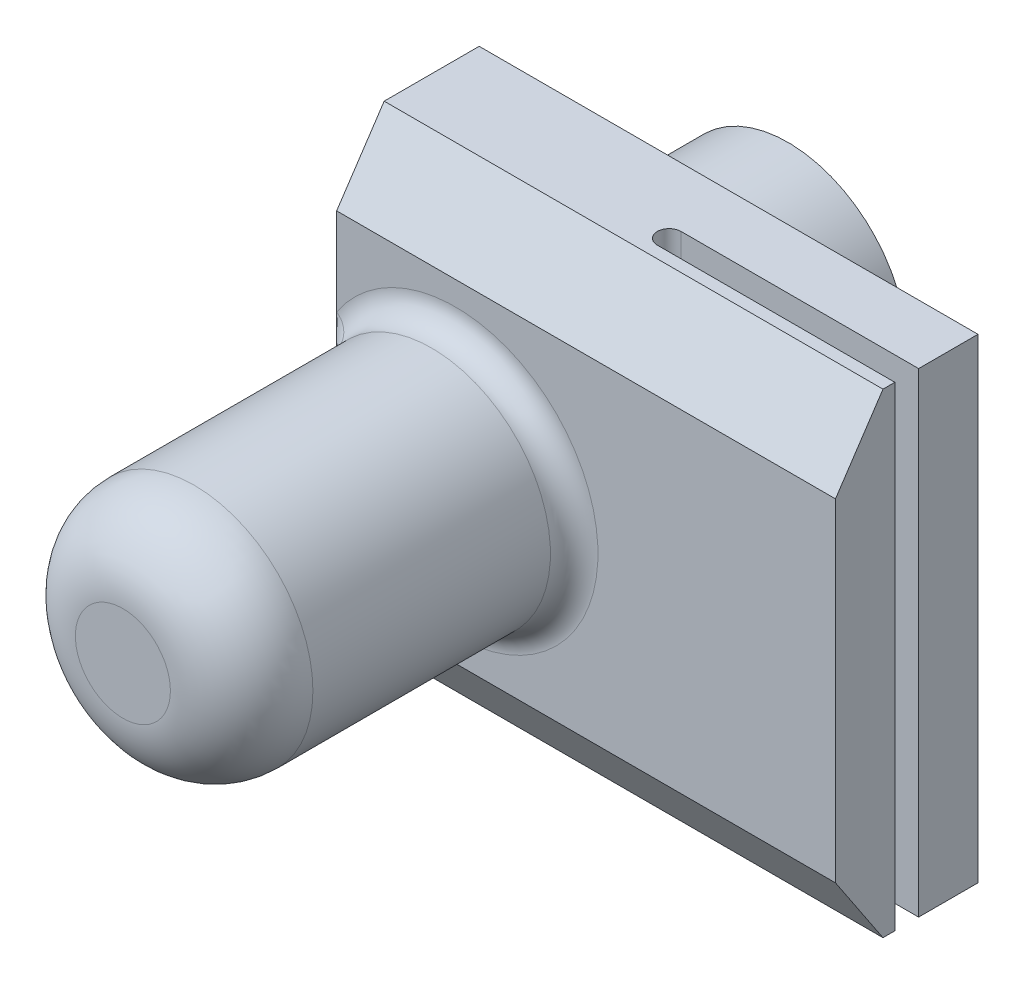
ISO-10303-21;
HEADER;
FILE_DESCRIPTION(('STEP AP214'),'2;1');
FILE_NAME('part.step','',(''),(''),'','','');
FILE_SCHEMA(('AUTOMOTIVE_DESIGN { 1 0 10303 214 1 1 1 1 }'));
ENDSEC;
DATA;
#1=APPLICATION_CONTEXT('core data for automotive mechanical design processes');
#2=APPLICATION_PROTOCOL_DEFINITION('international standard','automotive_design',2000,#1);
#3=PRODUCT_CONTEXT('',#1,'mechanical');
#4=PRODUCT('Part','Part','',(#3));
#5=PRODUCT_RELATED_PRODUCT_CATEGORY('part','',(#4));
#6=PRODUCT_DEFINITION_FORMATION('','',#4);
#7=PRODUCT_DEFINITION_CONTEXT('part definition',#1,'design');
#8=PRODUCT_DEFINITION('design','',#6,#7);
#9=PRODUCT_DEFINITION_SHAPE('','',#8);
#10=(LENGTH_UNIT() NAMED_UNIT(*) SI_UNIT(.MILLI.,.METRE.));
#11=(NAMED_UNIT(*) PLANE_ANGLE_UNIT() SI_UNIT($,.RADIAN.));
#12=(NAMED_UNIT(*) SI_UNIT($,.STERADIAN.) SOLID_ANGLE_UNIT());
#13=UNCERTAINTY_MEASURE_WITH_UNIT(LENGTH_MEASURE(1.E-05),#10,'distance_accuracy_value','');
#14=(GEOMETRIC_REPRESENTATION_CONTEXT(3) GLOBAL_UNCERTAINTY_ASSIGNED_CONTEXT((#13)) GLOBAL_UNIT_ASSIGNED_CONTEXT((#10,
#11,#12)) REPRESENTATION_CONTEXT('',''));
#15=CARTESIAN_POINT('',(0.,0.,0.));
#16=DIRECTION('',(0.,0.,1.));
#17=DIRECTION('',(1.,0.,0.));
#18=AXIS2_PLACEMENT_3D('',#15,#16,#17);
#19=CARTESIAN_POINT('',(8.,0.,-3.));
#20=DIRECTION('',(1.,0.,0.));
#21=DIRECTION('',(0.,1.,0.));
#22=AXIS2_PLACEMENT_3D('',#19,#20,#21);
#23=PLANE('',#22);
#24=DIRECTION('',(0.,0.,-1.));
#25=VECTOR('',#24,1.);
#26=CARTESIAN_POINT('',(8.,5.,-3.));
#27=LINE('',#26,#25);
#28=CARTESIAN_POINT('',(8.,5.,-4.75));
#29=VERTEX_POINT('',#28);
#30=CARTESIAN_POINT('',(8.,5.,-6.));
#31=VERTEX_POINT('',#30);
#32=EDGE_CURVE('E146',#29,#31,#27,.T.);
#33=ORIENTED_EDGE('',*,*,#32,.F.);
#34=DIRECTION('',(0.,1.,0.));
#35=VECTOR('',#34,1.);
#36=CARTESIAN_POINT('',(8.,-5.,-4.75));
#37=LINE('',#36,#35);
#38=CARTESIAN_POINT('',(8.,-5.,-4.75));
#39=VERTEX_POINT('',#38);
#40=EDGE_CURVE('E198',#39,#29,#37,.T.);
#41=ORIENTED_EDGE('',*,*,#40,.F.);
#42=DIRECTION('',(0.,0.,-1.));
#43=VECTOR('',#42,1.);
#44=CARTESIAN_POINT('',(8.,-5.,-3.));
#45=LINE('',#44,#43);
#46=CARTESIAN_POINT('',(8.,-5.,-6.));
#47=VERTEX_POINT('',#46);
#48=EDGE_CURVE('E218',#39,#47,#45,.T.);
#49=ORIENTED_EDGE('',*,*,#48,.T.);
#50=DIRECTION('',(0.,-1.,0.));
#51=VECTOR('',#50,1.);
#52=CARTESIAN_POINT('',(8.,0.,-6.));
#53=LINE('',#52,#51);
#54=EDGE_CURVE('E156',#31,#47,#53,.T.);
#55=ORIENTED_EDGE('',*,*,#54,.F.);
#56=EDGE_LOOP('',(#33,#41,#49,#55));
#57=FACE_BOUND('',#56,.T.);
#58=ADVANCED_FACE('F27',(#57),#23,.T.);
#59=DIRECTION('',(0.,-1.,0.));
#60=VECTOR('',#59,1.);
#61=CARTESIAN_POINT('',(8.,0.,-3.));
#62=LINE('',#61,#60);
#63=CARTESIAN_POINT('',(8.,3.49999999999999,-3.));
#64=VERTEX_POINT('',#63);
#65=CARTESIAN_POINT('',(8.,-3.49999999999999,-3.));
#66=VERTEX_POINT('',#65);
#67=EDGE_CURVE('E213',#64,#66,#62,.T.);
#68=ORIENTED_EDGE('',*,*,#67,.T.);
#69=DIRECTION('',(0.,-0.832050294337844,-0.554700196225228));
#70=VECTOR('',#69,1.);
#71=CARTESIAN_POINT('',(8.,-1.07692307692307,-1.38461538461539));
#72=LINE('',#71,#70);
#73=CARTESIAN_POINT('',(8.,-5.,-4.));
#74=VERTEX_POINT('',#73);
#75=EDGE_CURVE('E11',#66,#74,#72,.T.);
#76=ORIENTED_EDGE('',*,*,#75,.T.);
#77=CARTESIAN_POINT('',(8.,-5.,-4.25));
#78=VERTEX_POINT('',#77);
#79=EDGE_CURVE('E152',#74,#78,#45,.T.);
#80=ORIENTED_EDGE('',*,*,#79,.T.);
#81=DIRECTION('',(0.,1.,0.));
#82=VECTOR('',#81,1.);
#83=CARTESIAN_POINT('',(8.,-5.,-4.25));
#84=LINE('',#83,#82);
#85=CARTESIAN_POINT('',(8.,5.,-4.25));
#86=VERTEX_POINT('',#85);
#87=EDGE_CURVE('E149',#78,#86,#84,.T.);
#88=ORIENTED_EDGE('',*,*,#87,.T.);
#89=CARTESIAN_POINT('',(8.,5.,-4.00000000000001));
#90=VERTEX_POINT('',#89);
#91=EDGE_CURVE('E134',#90,#86,#27,.T.);
#92=ORIENTED_EDGE('',*,*,#91,.F.);
#93=DIRECTION('',(0.,0.832050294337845,-0.554700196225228));
#94=VECTOR('',#93,1.);
#95=CARTESIAN_POINT('',(8.,1.07692307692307,-1.38461538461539));
#96=LINE('',#95,#94);
#97=EDGE_CURVE('E368',#90,#64,#96,.F.);
#98=ORIENTED_EDGE('',*,*,#97,.T.);
#99=EDGE_LOOP('',(#68,#76,#80,#88,#92,#98));
#100=FACE_BOUND('',#99,.T.);
#101=ADVANCED_FACE('F150',(#100),#23,.T.);
#102=CARTESIAN_POINT('',(8.,5.,-3.));
#103=DIRECTION('',(0.,-1.,0.));
#104=DIRECTION('',(0.,0.,-1.));
#105=AXIS2_PLACEMENT_3D('',#102,#103,#104);
#106=PLANE('',#105);
#107=DIRECTION('',(0.,0.,-1.));
#108=VECTOR('',#107,1.);
#109=CARTESIAN_POINT('',(-2.5,5.,-3.));
#110=LINE('',#109,#108);
#111=CARTESIAN_POINT('',(-2.5,5.,-4.));
#112=VERTEX_POINT('',#111);
#113=CARTESIAN_POINT('',(-2.5,5.,-6.));
#114=VERTEX_POINT('',#113);
#115=EDGE_CURVE('E189',#112,#114,#110,.T.);
#116=ORIENTED_EDGE('',*,*,#115,.F.);
#117=DIRECTION('',(1.,0.,0.));
#118=VECTOR('',#117,1.);
#119=CARTESIAN_POINT('',(8.,5.,-4.));
#120=LINE('',#119,#118);
#121=EDGE_CURVE('E142',#112,#90,#120,.T.);
#122=ORIENTED_EDGE('',*,*,#121,.T.);
#123=ORIENTED_EDGE('',*,*,#91,.T.);
#124=DIRECTION('',(1.,0.,0.));
#125=VECTOR('',#124,1.);
#126=CARTESIAN_POINT('',(8.,5.,-4.25));
#127=LINE('',#126,#125);
#128=CARTESIAN_POINT('',(3.,5.,-4.25));
#129=VERTEX_POINT('',#128);
#130=EDGE_CURVE('E140',#129,#86,#127,.T.);
#131=ORIENTED_EDGE('',*,*,#130,.F.);
#132=CARTESIAN_POINT('',(3.,5.,-4.5));
#133=DIRECTION('',(0.,1.,0.));
#134=DIRECTION('',(1.,0.,0.));
#135=AXIS2_PLACEMENT_3D('',#132,#133,#134);
#136=CIRCLE('',#135,0.25);
#137=CARTESIAN_POINT('',(3.,5.,-4.75));
#138=VERTEX_POINT('',#137);
#139=EDGE_CURVE('E161',#138,#129,#136,.T.);
#140=ORIENTED_EDGE('',*,*,#139,.F.);
#141=DIRECTION('',(-1.,0.,0.));
#142=VECTOR('',#141,1.);
#143=CARTESIAN_POINT('',(8.,5.,-4.75));
#144=LINE('',#143,#142);
#145=EDGE_CURVE('E164',#29,#138,#144,.T.);
#146=ORIENTED_EDGE('',*,*,#145,.F.);
#147=ORIENTED_EDGE('',*,*,#32,.T.);
#148=DIRECTION('',(-1.,0.,0.));
#149=VECTOR('',#148,1.);
#150=CARTESIAN_POINT('',(8.,5.,-6.));
#151=LINE('',#150,#149);
#152=EDGE_CURVE('E184',#31,#114,#151,.T.);
#153=ORIENTED_EDGE('',*,*,#152,.T.);
#154=EDGE_LOOP('',(#116,#122,#123,#131,#140,#146,#147,#153));
#155=FACE_BOUND('',#154,.T.);
#156=ADVANCED_FACE('F137',(#155),#106,.F.);
#157=CARTESIAN_POINT('',(0.,0.,4.));
#158=DIRECTION('',(0.,0.,-1.));
#159=DIRECTION('',(-1.,0.,0.));
#160=AXIS2_PLACEMENT_3D('',#157,#158,#159);
#161=CYLINDRICAL_SURFACE('',#160,2.5);
#162=CARTESIAN_POINT('',(0.,0.,2.5));
#163=DIRECTION('',(0.,0.,1.));
#164=DIRECTION('',(1.,0.,0.));
#165=AXIS2_PLACEMENT_3D('',#162,#163,#164);
#166=CIRCLE('',#165,2.5);
#167=CARTESIAN_POINT('',(2.5,0.,2.5));
#168=VERTEX_POINT('',#167);
#169=EDGE_CURVE('E228',#168,#168,#166,.F.);
#170=ORIENTED_EDGE('',*,*,#169,.T.);
#171=EDGE_LOOP('',(#170));
#172=FACE_BOUND('',#171,.T.);
#173=CARTESIAN_POINT('',(-1.92386361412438,1.59648012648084,-2.53806932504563));
#174=CARTESIAN_POINT('',(-2.03448154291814,1.46317824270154,-3.19284997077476));
#175=CARTESIAN_POINT('',(-2.5,1.915776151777,-3.));
#176=CARTESIAN_POINT('',(-1.94000799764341,1.57703152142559,-2.53005779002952));
#177=CARTESIAN_POINT('',(-2.03247745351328,1.46291626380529,-3.17117851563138));
#178=CARTESIAN_POINT('',(-2.5,1.89243782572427,-3.));
#179=CARTESIAN_POINT('',(-1.9560330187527,1.5571135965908,-2.52350246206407));
#180=CARTESIAN_POINT('',(-2.03313483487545,1.45996457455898,-3.14967894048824));
#181=CARTESIAN_POINT('',(-2.5,1.86853631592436,-3.));
#182=CARTESIAN_POINT('',(-1.98765004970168,1.5165428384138,-2.51296198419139));
#183=CARTESIAN_POINT('',(-2.0386169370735,1.44943469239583,-3.10880591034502));
#184=CARTESIAN_POINT('',(-2.5,1.81985140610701,-3.));
#185=CARTESIAN_POINT('',(-2.00324291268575,1.49589166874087,-2.50897136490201));
#186=CARTESIAN_POINT('',(-2.0432915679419,1.44202132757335,-3.08933820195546));
#187=CARTESIAN_POINT('',(-2.5,1.79507000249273,-3.));
#188=CARTESIAN_POINT('',(-2.04886384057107,1.43345572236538,-2.50035543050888));
#189=CARTESIAN_POINT('',(-2.06119456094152,1.41480948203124,-3.03613582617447));
#190=CARTESIAN_POINT('',(-2.5,1.72014686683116,-3.));
#191=CARTESIAN_POINT('',(-2.07807996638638,1.39077306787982,-2.49893314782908));
#192=CARTESIAN_POINT('',(-2.07841750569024,1.38972796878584,-3.00480190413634));
#193=CARTESIAN_POINT('',(-2.5,1.66892768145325,-3.));
#194=CARTESIAN_POINT('',(-2.15204684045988,1.27515681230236,-2.50372081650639));
#195=CARTESIAN_POINT('',(-2.1291988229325,1.31166883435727,-2.93716651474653));
#196=CARTESIAN_POINT('',(-2.5,1.53018817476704,-3.));
#197=CARTESIAN_POINT('',(-2.19432512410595,1.20084875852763,-2.51558708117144));
#198=CARTESIAN_POINT('',(-2.16711998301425,1.25004161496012,-2.90676568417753));
#199=CARTESIAN_POINT('',(-2.5,1.44101851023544,-3.));
#200=CARTESIAN_POINT('',(-2.2706844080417,1.04941586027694,-2.55069569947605));
#201=CARTESIAN_POINT('',(-2.24051476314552,1.11375802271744,-2.86830827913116));
#202=CARTESIAN_POINT('',(-2.5,1.25929903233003,-3.));
#203=CARTESIAN_POINT('',(-2.30469813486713,0.972273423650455,-2.57402702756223));
#204=CARTESIAN_POINT('',(-2.27668083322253,1.03878764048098,-2.85872423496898));
#205=CARTESIAN_POINT('',(-2.5,1.16672810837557,-3.));
#206=CARTESIAN_POINT('',(-2.35845576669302,0.831962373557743,-2.62277891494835));
#207=CARTESIAN_POINT('',(-2.33532856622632,0.89741027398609,-2.85445934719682));
#208=CARTESIAN_POINT('',(-2.5,0.998354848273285,-3.));
#209=CARTESIAN_POINT('',(-2.37969067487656,0.76903261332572,-2.6468838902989));
#210=CARTESIAN_POINT('',(-2.35933200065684,0.832328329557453,-2.85682441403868));
#211=CARTESIAN_POINT('',(-2.5,0.922839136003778,-3.));
#212=CARTESIAN_POINT('',(-2.41691103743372,0.642566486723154,-2.69845447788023));
#213=CARTESIAN_POINT('',(-2.40174950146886,0.699805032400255,-2.86783553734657));
#214=CARTESIAN_POINT('',(-2.5,0.771079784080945,-3.));
#215=CARTESIAN_POINT('',(-2.43289309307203,0.57902975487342,-2.72592225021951));
#216=CARTESIAN_POINT('',(-2.42047891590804,0.631909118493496,-2.87635645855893));
#217=CARTESIAN_POINT('',(-2.5,0.69483570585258,-3.));
#218=CARTESIAN_POINT('',(-2.47308831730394,0.388200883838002,-2.81149591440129));
#219=CARTESIAN_POINT('',(-2.46702618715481,0.428710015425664,-2.90769767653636));
#220=CARTESIAN_POINT('',(-2.5,0.465841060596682,-3.));
#221=CARTESIAN_POINT('',(-2.48971615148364,0.260249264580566,-2.87294115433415));
#222=CARTESIAN_POINT('',(-2.48758924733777,0.286696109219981,-2.9369540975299));
#223=CARTESIAN_POINT('',(-2.5,0.312299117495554,-3.));
#224=CARTESIAN_POINT('',(-2.49868390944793,0.0910319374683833,-2.95541315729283));
#225=CARTESIAN_POINT('',(-2.49843059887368,0.100199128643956,-2.97769870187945));
#226=CARTESIAN_POINT('',(-2.5,0.109238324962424,-3.));
#227=CARTESIAN_POINT('',(-2.49984614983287,0.0497443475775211,-2.97563094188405));
#228=CARTESIAN_POINT('',(-2.49981606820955,0.0547228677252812,-2.98781496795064));
#229=CARTESIAN_POINT('',(-2.5,0.0596932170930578,-3.));
#230=CARTESIAN_POINT('',(-2.49999523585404,0.00563439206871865,-2.99723971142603));
#231=CARTESIAN_POINT('',(-2.4999942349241,0.00619785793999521,-2.99861986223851));
#232=CARTESIAN_POINT('',(-2.5,0.00676127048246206,-3.));
#233=CARTESIAN_POINT('',(-2.49999999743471,0.00281720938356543,-2.99861984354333));
#234=CARTESIAN_POINT('',(-2.49999994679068,0.00309893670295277,-2.99930993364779));
#235=CARTESIAN_POINT('',(-2.5,0.0033806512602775,-3.));
#236=CARTESIAN_POINT('',(-2.5,0.,-3.));
#237=CARTESIAN_POINT('',(-2.5,0.,-3.));
#238=CARTESIAN_POINT('',(-2.5,0.,-3.));
#239=(BOUNDED_SURFACE() B_SPLINE_SURFACE(3,2,((#173,#174,#175),(#176,#177,#178),(#179,#180,
#181),(#182,#183,#184),(#185,#186,#187),(#188,#189,#190),(#191,#192,#193),(#194,#195,#196),
(#197,#198,#199),(#200,#201,#202),(#203,#204,#205),(#206,#207,#208),(#209,#210,#211),(#212,#213,
#214),(#215,#216,#217),(#218,#219,#220),(#221,#222,#223),(#224,#225,#226),(#227,#228,#229),
(#230,#231,#232),(#233,#234,#235),(#236,#237,#238)),.UNSPECIFIED.,.F.,.F.,
.F.) B_SPLINE_SURFACE_WITH_KNOTS((4,2,2,2,2,2,2,2,2,2,4),(3,3),(0.,0.0940135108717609,
0.187825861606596,0.373475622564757,0.681644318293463,0.992243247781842,1.24169439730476,
1.4913066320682,1.98878105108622,2.14934727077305,2.16030173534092),(0.,1.),
.UNSPECIFIED.) GEOMETRIC_REPRESENTATION_ITEM() RATIONAL_B_SPLINE_SURFACE(((1.,0.593916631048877,
1.),(1.,0.605427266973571,1.),(1.,0.61683432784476,1.),(1.,0.639310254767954,1.),(1.,
0.650379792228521,1.),(1.,0.682731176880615,1.),(1.,0.703401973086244,1.),(1.,0.755659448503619,
1.),(1.,0.785447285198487,1.),(1.,0.839178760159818,1.),(1.,0.863074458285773,1.),(1.,
0.900811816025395,1.),(1.,0.915706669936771,1.),(1.,0.941803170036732,1.),(1.,0.953002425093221,
1.),(1.,0.981162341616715,1.),(1.,0.992801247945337,1.),(1.,0.999078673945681,1.),(1.,
0.999892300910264,1.),(1.,0.999996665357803,1.),(1.,0.999999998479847,1.),(1.,1.,1.))) REPRESENTATION_ITEM('') SURFACE());
#240=CARTESIAN_POINT('',(-1.92386361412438,1.59648012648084,-2.53806932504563));
#241=CARTESIAN_POINT('',(-1.94000799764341,1.57703152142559,-2.53005779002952));
#242=CARTESIAN_POINT('',(-1.9560330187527,1.5571135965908,-2.52350246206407));
#243=CARTESIAN_POINT('',(-1.98765004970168,1.5165428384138,-2.51296198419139));
#244=CARTESIAN_POINT('',(-2.00324291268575,1.49589166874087,-2.50897136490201));
#245=CARTESIAN_POINT('',(-2.04886384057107,1.43345572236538,-2.50035543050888));
#246=CARTESIAN_POINT('',(-2.07807996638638,1.39077306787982,-2.49893314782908));
#247=CARTESIAN_POINT('',(-2.15204684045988,1.27515681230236,-2.50372081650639));
#248=CARTESIAN_POINT('',(-2.19432512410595,1.20084875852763,-2.51558708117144));
#249=CARTESIAN_POINT('',(-2.2706844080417,1.04941586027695,-2.55069569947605));
#250=CARTESIAN_POINT('',(-2.30469813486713,0.972273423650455,-2.57402702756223));
#251=CARTESIAN_POINT('',(-2.35845576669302,0.831962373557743,-2.62277891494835));
#252=CARTESIAN_POINT('',(-2.37969067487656,0.76903261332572,-2.6468838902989));
#253=CARTESIAN_POINT('',(-2.41691103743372,0.642566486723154,-2.69845447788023));
#254=CARTESIAN_POINT('',(-2.43289309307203,0.57902975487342,-2.72592225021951));
#255=CARTESIAN_POINT('',(-2.47308831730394,0.388200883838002,-2.81149591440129));
#256=CARTESIAN_POINT('',(-2.48971615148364,0.260249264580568,-2.87294115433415));
#257=CARTESIAN_POINT('',(-2.49868390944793,0.0910319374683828,-2.95541315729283));
#258=CARTESIAN_POINT('',(-2.49984614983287,0.0497443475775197,-2.97563094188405));
#259=CARTESIAN_POINT('',(-2.49999523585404,0.00563439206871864,-2.99723971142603));
#260=CARTESIAN_POINT('',(-2.49999999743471,0.00281720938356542,-2.99861984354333));
#261=CARTESIAN_POINT('',(-2.5,0.,-3.));
#262=B_SPLINE_CURVE_WITH_KNOTS('',3,(#240,#241,#242,#243,#244,#245,#246,#247,#248,#249,#250,
#251,#252,#253,#254,#255,#256,#257,#258,#259,#260,#261),.UNSPECIFIED.,.F.,.F.,(4,2,2,2,2,2,2,2,
2,2,4),(0.,0.0940135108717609,0.187825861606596,0.373475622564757,0.681644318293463,
0.992243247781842,1.24169439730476,1.4913066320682,1.98878105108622,2.14934727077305,
2.16030173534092),.UNSPECIFIED.);
#263=CARTESIAN_POINT('',(-2.08333333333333,1.38192699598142,-2.5));
#264=VERTEX_POINT('',#263);
#265=CARTESIAN_POINT('',(-2.5,0.,-3.));
#266=VERTEX_POINT('',#265);
#267=EDGE_CURVE('E343',#264,#266,#262,.T.);
#268=ORIENTED_EDGE('',*,*,#267,.T.);
#269=CARTESIAN_POINT('',(-2.5,-1.91577615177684,-3.));
#270=CARTESIAN_POINT('',(-2.03448154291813,-1.46317824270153,-3.1928499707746));
#271=CARTESIAN_POINT('',(-1.92386361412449,-1.5964801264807,-2.53806932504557));
#272=CARTESIAN_POINT('',(-2.5,-1.8924378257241,-3.));
#273=CARTESIAN_POINT('',(-2.03247745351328,-1.46291626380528,-3.17117851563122));
#274=CARTESIAN_POINT('',(-1.94000799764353,-1.57703152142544,-2.53005779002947));
#275=CARTESIAN_POINT('',(-2.5,-1.86853631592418,-3.));
#276=CARTESIAN_POINT('',(-2.03313483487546,-1.45996457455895,-3.14967894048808));
#277=CARTESIAN_POINT('',(-1.95603301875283,-1.55711359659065,-2.52350246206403));
#278=CARTESIAN_POINT('',(-2.5,-1.81985140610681,-3.));
#279=CARTESIAN_POINT('',(-2.03861693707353,-1.44943469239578,-3.10880591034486));
#280=CARTESIAN_POINT('',(-1.98765004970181,-1.51654283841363,-2.51296198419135));
#281=CARTESIAN_POINT('',(-2.5,-1.79507000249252,-3.));
#282=CARTESIAN_POINT('',(-2.04329156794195,-1.44202132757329,-3.0893382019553));
#283=CARTESIAN_POINT('',(-2.00324291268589,-1.49589166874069,-2.50897136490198));
#284=CARTESIAN_POINT('',(-2.5,-1.72014686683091,-3.));
#285=CARTESIAN_POINT('',(-2.0611945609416,-1.41480948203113,-3.03613582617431));
#286=CARTESIAN_POINT('',(-2.04886384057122,-1.43345572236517,-2.50035543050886));
#287=CARTESIAN_POINT('',(-2.5,-1.66892768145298,-3.));
#288=CARTESIAN_POINT('',(-2.07841750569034,-1.3897279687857,-3.00480190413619));
#289=CARTESIAN_POINT('',(-2.07807996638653,-1.3907730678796,-2.49893314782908));
#290=CARTESIAN_POINT('',(-2.5,-1.53018817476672,-3.));
#291=CARTESIAN_POINT('',(-2.12919882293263,-1.31166883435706,-2.9371665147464));
#292=CARTESIAN_POINT('',(-2.15204684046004,-1.27515681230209,-2.50372081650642));
#293=CARTESIAN_POINT('',(-2.5,-1.44101851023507,-3.));
#294=CARTESIAN_POINT('',(-2.16711998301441,-1.25004161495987,-2.90676568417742));
#295=CARTESIAN_POINT('',(-2.19432512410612,-1.20084875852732,-2.5155870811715));
#296=CARTESIAN_POINT('',(-2.5,-1.25929903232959,-3.));
#297=CARTESIAN_POINT('',(-2.2405147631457,-1.11375802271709,-2.86830827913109));
#298=CARTESIAN_POINT('',(-2.27068440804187,-1.04941586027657,-2.55069569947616));
#299=CARTESIAN_POINT('',(-2.5,-1.16672810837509,-3.));
#300=CARTESIAN_POINT('',(-2.27668083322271,-1.03878764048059,-2.85872423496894));
#301=CARTESIAN_POINT('',(-2.3046981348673,-0.972273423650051,-2.57402702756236));
#302=CARTESIAN_POINT('',(-2.5,-0.998354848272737,-3.));
#303=CARTESIAN_POINT('',(-2.3353285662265,-0.897410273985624,-2.85445934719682));
#304=CARTESIAN_POINT('',(-2.35845576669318,-0.831962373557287,-2.62277891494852));
#305=CARTESIAN_POINT('',(-2.5,-0.922839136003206,-3.));
#306=CARTESIAN_POINT('',(-2.35933200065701,-0.83232832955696,-2.85682441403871));
#307=CARTESIAN_POINT('',(-2.37969067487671,-0.769032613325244,-2.64688389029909));
#308=CARTESIAN_POINT('',(-2.5,-0.771079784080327,-3.));
#309=CARTESIAN_POINT('',(-2.40174950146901,-0.699805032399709,-2.86783553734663));
#310=CARTESIAN_POINT('',(-2.41691103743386,-0.642566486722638,-2.69845447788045));
#311=CARTESIAN_POINT('',(-2.5,-0.694835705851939,-3.));
#312=CARTESIAN_POINT('',(-2.42047891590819,-0.631909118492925,-2.87635645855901));
#313=CARTESIAN_POINT('',(-2.43289309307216,-0.579029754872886,-2.72592225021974));
#314=CARTESIAN_POINT('',(-2.5,-0.46584106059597,-3.));
#315=CARTESIAN_POINT('',(-2.46702618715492,-0.428710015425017,-2.90769767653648));
#316=CARTESIAN_POINT('',(-2.47308831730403,-0.388200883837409,-2.81149591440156));
#317=CARTESIAN_POINT('',(-2.5,-0.312299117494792,-3.));
#318=CARTESIAN_POINT('',(-2.48758924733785,-0.286696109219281,-2.93695409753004));
#319=CARTESIAN_POINT('',(-2.48971615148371,-0.26024926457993,-2.87294115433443));
#320=CARTESIAN_POINT('',(-2.5,-0.109238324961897,-3.));
#321=CARTESIAN_POINT('',(-2.49843059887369,-0.100199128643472,-2.97769870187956));
#322=CARTESIAN_POINT('',(-2.49868390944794,-0.0910319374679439,-2.95541315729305));
#323=CARTESIAN_POINT('',(-2.5,-0.0596932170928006,-3.));
#324=CARTESIAN_POINT('',(-2.49981606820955,-0.0547228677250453,-2.9878149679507));
#325=CARTESIAN_POINT('',(-2.49984614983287,-0.0497443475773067,-2.97563094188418));
#326=CARTESIAN_POINT('',(-2.5,-0.00676127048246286,-3.));
#327=CARTESIAN_POINT('',(-2.4999942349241,-0.00619785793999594,-2.99861986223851));
#328=CARTESIAN_POINT('',(-2.49999523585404,-0.00563439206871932,-2.99723971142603));
#329=CARTESIAN_POINT('',(-2.5,-0.00338065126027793,-3.));
#330=CARTESIAN_POINT('',(-2.49999994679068,-0.00309893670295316,-2.99930993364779));
#331=CARTESIAN_POINT('',(-2.49999999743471,-0.00281720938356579,-2.99861984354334));
#332=CARTESIAN_POINT('',(-2.5,0.,-3.));
#333=CARTESIAN_POINT('',(-2.5,0.,-3.));
#334=CARTESIAN_POINT('',(-2.5,0.,-3.));
#335=(BOUNDED_SURFACE() B_SPLINE_SURFACE(3,2,((#269,#270,#271),(#272,#273,#274),(#275,#276,
#277),(#278,#279,#280),(#281,#282,#283),(#284,#285,#286),(#287,#288,#289),(#290,#291,#292),
(#293,#294,#295),(#296,#297,#298),(#299,#300,#301),(#302,#303,#304),(#305,#306,#307),(#308,#309,
#310),(#311,#312,#313),(#314,#315,#316),(#317,#318,#319),(#320,#321,#322),(#323,#324,#325),
(#326,#327,#328),(#329,#330,#331),(#332,#333,#334)),.UNSPECIFIED.,.F.,.F.,
.F.) B_SPLINE_SURFACE_WITH_KNOTS((4,2,2,2,2,2,2,2,2,2,4),(3,3),(0.,0.0940135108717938,
0.187825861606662,0.373475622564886,0.681644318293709,0.992243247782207,1.2416943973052,
1.4913066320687,1.98878105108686,2.14934727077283,2.16030173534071),(0.,1.),
.UNSPECIFIED.) GEOMETRIC_REPRESENTATION_ITEM() RATIONAL_B_SPLINE_SURFACE(((1.,0.593916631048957,
1.),(1.,0.605427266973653,1.),(1.,0.616834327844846,1.),(1.,0.639310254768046,1.),(1.,
0.650379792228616,1.),(1.,0.682731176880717,1.),(1.,0.703401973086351,1.),(1.,0.755659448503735,
1.),(1.,0.785447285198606,1.),(1.,0.839178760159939,1.),(1.,0.863074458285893,1.),(1.,
0.900811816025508,1.),(1.,0.91570666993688,1.),(1.,0.941803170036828,1.),(1.,0.953002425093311,
1.),(1.,0.981162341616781,1.),(1.,0.992801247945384,1.),(1.,0.99907867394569,1.),(1.,
0.999892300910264,1.),(1.,0.999996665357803,1.),(1.,0.999999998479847,1.),(1.,1.,1.))) REPRESENTATION_ITEM('') SURFACE());
#336=CARTESIAN_POINT('',(-1.92386361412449,-1.5964801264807,-2.53806932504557));
#337=CARTESIAN_POINT('',(-1.94000799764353,-1.57703152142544,-2.53005779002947));
#338=CARTESIAN_POINT('',(-1.95603301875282,-1.55711359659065,-2.52350246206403));
#339=CARTESIAN_POINT('',(-1.98765004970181,-1.51654283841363,-2.51296198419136));
#340=CARTESIAN_POINT('',(-2.00324291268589,-1.49589166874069,-2.50897136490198));
#341=CARTESIAN_POINT('',(-2.04886384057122,-1.43345572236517,-2.50035543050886));
#342=CARTESIAN_POINT('',(-2.07807996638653,-1.3907730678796,-2.49893314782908));
#343=CARTESIAN_POINT('',(-2.15204684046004,-1.27515681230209,-2.50372081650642));
#344=CARTESIAN_POINT('',(-2.19432512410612,-1.20084875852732,-2.5155870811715));
#345=CARTESIAN_POINT('',(-2.27068440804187,-1.04941586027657,-2.55069569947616));
#346=CARTESIAN_POINT('',(-2.3046981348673,-0.972273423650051,-2.57402702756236));
#347=CARTESIAN_POINT('',(-2.35845576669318,-0.831962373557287,-2.62277891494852));
#348=CARTESIAN_POINT('',(-2.37969067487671,-0.769032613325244,-2.64688389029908));
#349=CARTESIAN_POINT('',(-2.41691103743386,-0.642566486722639,-2.69845447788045));
#350=CARTESIAN_POINT('',(-2.43289309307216,-0.579029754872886,-2.72592225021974));
#351=CARTESIAN_POINT('',(-2.47308831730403,-0.388200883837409,-2.81149591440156));
#352=CARTESIAN_POINT('',(-2.48971615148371,-0.26024926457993,-2.87294115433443));
#353=CARTESIAN_POINT('',(-2.49868390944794,-0.0910319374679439,-2.95541315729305));
#354=CARTESIAN_POINT('',(-2.49984614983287,-0.0497443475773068,-2.97563094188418));
#355=CARTESIAN_POINT('',(-2.49999523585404,-0.00563439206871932,-2.99723971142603));
#356=CARTESIAN_POINT('',(-2.49999999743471,-0.00281720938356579,-2.99861984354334));
#357=CARTESIAN_POINT('',(-2.5,0.,-3.));
#358=B_SPLINE_CURVE_WITH_KNOTS('',3,(#336,#337,#338,#339,#340,#341,#342,#343,#344,#345,#346,
#347,#348,#349,#350,#351,#352,#353,#354,#355,#356,#357),.UNSPECIFIED.,.F.,.F.,(4,2,2,2,2,2,2,2,
2,2,4),(0.,0.0940135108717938,0.187825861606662,0.373475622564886,0.681644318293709,
0.992243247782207,1.2416943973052,1.4913066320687,1.98878105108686,2.14934727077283,
2.16030173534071),.UNSPECIFIED.);
#359=CARTESIAN_POINT('',(-2.08333333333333,-1.38192699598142,-2.5));
#360=VERTEX_POINT('',#359);
#361=EDGE_CURVE('E352',#266,#360,#358,.F.);
#362=ORIENTED_EDGE('',*,*,#361,.T.);
#363=CARTESIAN_POINT('',(0.,0.,-2.5));
#364=DIRECTION('',(0.,0.,-1.));
#365=DIRECTION('',(-1.,0.,0.));
#366=AXIS2_PLACEMENT_3D('',#363,#364,#365);
#367=CIRCLE('',#366,2.5);
#368=EDGE_CURVE('E355',#360,#264,#367,.F.);
#369=ORIENTED_EDGE('',*,*,#368,.T.);
#370=EDGE_LOOP('',(#268,#362,#369));
#371=FACE_BOUND('',#370,.T.);
#372=ADVANCED_FACE('F419',(#172,#371),#161,.T.);
#373=CARTESIAN_POINT('',(0.,0.,-10.));
#374=DIRECTION('',(0.,0.,-1.));
#375=DIRECTION('',(-1.,0.,0.));
#376=AXIS2_PLACEMENT_3D('',#373,#374,#375);
#377=CIRCLE('',#376,2.5);
#378=CARTESIAN_POINT('',(-2.5,0.,-10.));
#379=VERTEX_POINT('',#378);
#380=EDGE_CURVE('E221',#379,#379,#377,.T.);
#381=ORIENTED_EDGE('',*,*,#380,.F.);
#382=EDGE_LOOP('',(#381));
#383=FACE_BOUND('',#382,.T.);
#384=CARTESIAN_POINT('',(-1.92386361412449,-1.5964801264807,-6.46193067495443));
#385=CARTESIAN_POINT('',(-2.03448154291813,-1.46317824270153,-5.80715002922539));
#386=CARTESIAN_POINT('',(-2.5,-1.91577615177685,-6.));
#387=CARTESIAN_POINT('',(-1.94000799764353,-1.57703152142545,-6.46994220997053));
#388=CARTESIAN_POINT('',(-2.03247745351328,-1.46291626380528,-5.82882148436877));
#389=CARTESIAN_POINT('',(-2.5,-1.8924378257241,-6.));
#390=CARTESIAN_POINT('',(-1.95603301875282,-1.55711359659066,-6.47649753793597));
#391=CARTESIAN_POINT('',(-2.03313483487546,-1.45996457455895,-5.85032105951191));
#392=CARTESIAN_POINT('',(-2.5,-1.86853631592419,-6.));
#393=CARTESIAN_POINT('',(-1.98765004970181,-1.51654283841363,-6.48703801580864));
#394=CARTESIAN_POINT('',(-2.03861693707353,-1.44943469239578,-5.89119408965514));
#395=CARTESIAN_POINT('',(-2.5,-1.81985140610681,-6.));
#396=CARTESIAN_POINT('',(-2.00324291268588,-1.4958916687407,-6.49102863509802));
#397=CARTESIAN_POINT('',(-2.04329156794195,-1.44202132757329,-5.9106617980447));
#398=CARTESIAN_POINT('',(-2.5,-1.79507000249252,-6.));
#399=CARTESIAN_POINT('',(-2.04886384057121,-1.43345572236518,-6.49964456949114));
#400=CARTESIAN_POINT('',(-2.0611945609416,-1.41480948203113,-5.96386417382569));
#401=CARTESIAN_POINT('',(-2.5,-1.72014686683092,-6.));
#402=CARTESIAN_POINT('',(-2.07807996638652,-1.3907730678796,-6.50106685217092));
#403=CARTESIAN_POINT('',(-2.07841750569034,-1.3897279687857,-5.99519809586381));
#404=CARTESIAN_POINT('',(-2.5,-1.66892768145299,-6.));
#405=CARTESIAN_POINT('',(-2.15204684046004,-1.27515681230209,-6.49627918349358));
#406=CARTESIAN_POINT('',(-2.12919882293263,-1.31166883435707,-6.0628334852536));
#407=CARTESIAN_POINT('',(-2.5,-1.53018817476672,-6.));
#408=CARTESIAN_POINT('',(-2.19432512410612,-1.20084875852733,-6.4844129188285));
#409=CARTESIAN_POINT('',(-2.1671199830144,-1.25004161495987,-6.09323431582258));
#410=CARTESIAN_POINT('',(-2.5,-1.44101851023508,-6.));
#411=CARTESIAN_POINT('',(-2.27068440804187,-1.04941586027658,-6.44930430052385));
#412=CARTESIAN_POINT('',(-2.2405147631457,-1.1137580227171,-6.13169172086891));
#413=CARTESIAN_POINT('',(-2.5,-1.25929903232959,-6.));
#414=CARTESIAN_POINT('',(-2.3046981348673,-0.972273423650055,-6.42597297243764));
#415=CARTESIAN_POINT('',(-2.27668083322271,-1.03878764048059,-6.14127576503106));
#416=CARTESIAN_POINT('',(-2.5,-1.1667281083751,-6.));
#417=CARTESIAN_POINT('',(-2.35845576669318,-0.831962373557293,-6.37722108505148));
#418=CARTESIAN_POINT('',(-2.3353285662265,-0.89741027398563,-6.14554065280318));
#419=CARTESIAN_POINT('',(-2.5,-0.998354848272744,-6.));
#420=CARTESIAN_POINT('',(-2.37969067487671,-0.76903261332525,-6.35311610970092));
#421=CARTESIAN_POINT('',(-2.35933200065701,-0.832328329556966,-6.14317558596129));
#422=CARTESIAN_POINT('',(-2.5,-0.922839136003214,-6.));
#423=CARTESIAN_POINT('',(-2.41691103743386,-0.642566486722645,-6.30154552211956));
#424=CARTESIAN_POINT('',(-2.40174950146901,-0.699805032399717,-6.13216446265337));
#425=CARTESIAN_POINT('',(-2.5,-0.771079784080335,-6.));
#426=CARTESIAN_POINT('',(-2.43289309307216,-0.579029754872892,-6.27407774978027));
#427=CARTESIAN_POINT('',(-2.42047891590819,-0.631909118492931,-6.12364354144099));
#428=CARTESIAN_POINT('',(-2.5,-0.694835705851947,-6.));
#429=CARTESIAN_POINT('',(-2.47308831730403,-0.388200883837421,-6.18850408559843));
#430=CARTESIAN_POINT('',(-2.46702618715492,-0.42871001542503,-6.09230232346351));
#431=CARTESIAN_POINT('',(-2.5,-0.465841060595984,-6.));
#432=CARTESIAN_POINT('',(-2.48971615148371,-0.260249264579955,-6.12705884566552));
#433=CARTESIAN_POINT('',(-2.48758924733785,-0.286696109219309,-6.06304590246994));
#434=CARTESIAN_POINT('',(-2.5,-0.312299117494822,-6.));
#435=CARTESIAN_POINT('',(-2.49868390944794,-0.0910319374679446,-6.04458684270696));
#436=CARTESIAN_POINT('',(-2.49843059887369,-0.100199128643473,-6.02230129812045));
#437=CARTESIAN_POINT('',(-2.5,-0.109238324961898,-6.));
#438=CARTESIAN_POINT('',(-2.49984614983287,-0.049744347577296,-6.02436905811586));
#439=CARTESIAN_POINT('',(-2.49981606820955,-0.0547228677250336,-6.01218503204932));
#440=CARTESIAN_POINT('',(-2.5,-0.0596932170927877,-6.));
#441=CARTESIAN_POINT('',(-2.49999523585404,-0.00563439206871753,-6.00276028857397));
#442=CARTESIAN_POINT('',(-2.4999942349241,-0.00619785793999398,-6.00138013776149));
#443=CARTESIAN_POINT('',(-2.5,-0.00676127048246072,-6.));
#444=CARTESIAN_POINT('',(-2.49999999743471,-0.00281720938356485,-6.00138015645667));
#445=CARTESIAN_POINT('',(-2.49999994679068,-0.00309893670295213,-6.00069006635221));
#446=CARTESIAN_POINT('',(-2.5,-0.0033806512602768,-6.));
#447=CARTESIAN_POINT('',(-2.5,0.,-6.));
#448=CARTESIAN_POINT('',(-2.5,0.,-6.));
#449=CARTESIAN_POINT('',(-2.5,0.,-6.));
#450=(BOUNDED_SURFACE() B_SPLINE_SURFACE(3,2,((#384,#385,#386),(#387,#388,#389),(#390,#391,
#392),(#393,#394,#395),(#396,#397,#398),(#399,#400,#401),(#402,#403,#404),(#405,#406,#407),
(#408,#409,#410),(#411,#412,#413),(#414,#415,#416),(#417,#418,#419),(#420,#421,#422),(#423,#424,
#425),(#426,#427,#428),(#429,#430,#431),(#432,#433,#434),(#435,#436,#437),(#438,#439,#440),
(#441,#442,#443),(#444,#445,#446),(#447,#448,#449)),.UNSPECIFIED.,.F.,.F.,
.F.) B_SPLINE_SURFACE_WITH_KNOTS((4,2,2,2,2,2,2,2,2,2,4),(3,3),(0.,0.0940135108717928,
0.187825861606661,0.373475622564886,0.681644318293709,0.992243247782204,1.24169439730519,
1.4913066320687,1.98878105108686,2.14934727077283,2.16030173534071),(0.,1.),
.UNSPECIFIED.) GEOMETRIC_REPRESENTATION_ITEM() RATIONAL_B_SPLINE_SURFACE(((1.,0.593916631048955,
1.),(1.,0.605427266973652,1.),(1.,0.616834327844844,1.),(1.,0.639310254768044,1.),(1.,
0.650379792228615,1.),(1.,0.682731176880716,1.),(1.,0.703401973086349,1.),(1.,0.755659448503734,
1.),(1.,0.785447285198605,1.),(1.,0.839178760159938,1.),(1.,0.863074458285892,1.),(1.,
0.900811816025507,1.),(1.,0.915706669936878,1.),(1.,0.941803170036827,1.),(1.,0.95300242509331,
1.),(1.,0.98116234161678,1.),(1.,0.992801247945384,1.),(1.,0.99907867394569,1.),(1.,
0.999892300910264,1.),(1.,0.999996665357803,1.),(1.,0.999999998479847,1.),(1.,1.,1.))) REPRESENTATION_ITEM('') SURFACE());
#451=CARTESIAN_POINT('',(-1.92386361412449,-1.5964801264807,-6.46193067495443));
#452=CARTESIAN_POINT('',(-1.94000799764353,-1.57703152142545,-6.46994220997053));
#453=CARTESIAN_POINT('',(-1.95603301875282,-1.55711359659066,-6.47649753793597));
#454=CARTESIAN_POINT('',(-1.98765004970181,-1.51654283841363,-6.48703801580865));
#455=CARTESIAN_POINT('',(-2.00324291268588,-1.4958916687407,-6.49102863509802));
#456=CARTESIAN_POINT('',(-2.04886384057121,-1.43345572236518,-6.49964456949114));
#457=CARTESIAN_POINT('',(-2.07807996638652,-1.3907730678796,-6.50106685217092));
#458=CARTESIAN_POINT('',(-2.15204684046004,-1.27515681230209,-6.49627918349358));
#459=CARTESIAN_POINT('',(-2.19432512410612,-1.20084875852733,-6.4844129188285));
#460=CARTESIAN_POINT('',(-2.27068440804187,-1.04941586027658,-6.44930430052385));
#461=CARTESIAN_POINT('',(-2.3046981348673,-0.972273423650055,-6.42597297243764));
#462=CARTESIAN_POINT('',(-2.35845576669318,-0.831962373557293,-6.37722108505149));
#463=CARTESIAN_POINT('',(-2.37969067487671,-0.76903261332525,-6.35311610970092));
#464=CARTESIAN_POINT('',(-2.41691103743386,-0.642566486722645,-6.30154552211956));
#465=CARTESIAN_POINT('',(-2.43289309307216,-0.579029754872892,-6.27407774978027));
#466=CARTESIAN_POINT('',(-2.47308831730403,-0.388200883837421,-6.18850408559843));
#467=CARTESIAN_POINT('',(-2.48971615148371,-0.260249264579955,-6.12705884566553));
#468=CARTESIAN_POINT('',(-2.49868390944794,-0.0910319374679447,-6.04458684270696));
#469=CARTESIAN_POINT('',(-2.49984614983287,-0.0497443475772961,-6.02436905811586));
#470=CARTESIAN_POINT('',(-2.49999523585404,-0.00563439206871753,-6.00276028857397));
#471=CARTESIAN_POINT('',(-2.49999999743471,-0.00281720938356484,-6.00138015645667));
#472=CARTESIAN_POINT('',(-2.5,0.,-6.));
#473=B_SPLINE_CURVE_WITH_KNOTS('',3,(#451,#452,#453,#454,#455,#456,#457,#458,#459,#460,#461,
#462,#463,#464,#465,#466,#467,#468,#469,#470,#471,#472),.UNSPECIFIED.,.F.,.F.,(4,2,2,2,2,2,2,2,
2,2,4),(0.,0.0940135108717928,0.187825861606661,0.373475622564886,0.681644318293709,
0.992243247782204,1.24169439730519,1.4913066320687,1.98878105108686,2.14934727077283,
2.16030173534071),.UNSPECIFIED.);
#474=CARTESIAN_POINT('',(-2.08333333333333,-1.38192699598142,-6.5));
#475=VERTEX_POINT('',#474);
#476=CARTESIAN_POINT('',(-2.5,0.,-6.));
#477=VERTEX_POINT('',#476);
#478=EDGE_CURVE('E231',#475,#477,#473,.T.);
#479=ORIENTED_EDGE('',*,*,#478,.T.);
#480=CARTESIAN_POINT('',(-2.5,1.915776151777,-6.));
#481=CARTESIAN_POINT('',(-2.03448154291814,1.46317824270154,-5.80715002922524));
#482=CARTESIAN_POINT('',(-1.92386361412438,1.59648012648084,-6.46193067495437));
#483=CARTESIAN_POINT('',(-2.5,1.89243782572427,-6.));
#484=CARTESIAN_POINT('',(-2.03247745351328,1.46291626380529,-5.82882148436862));
#485=CARTESIAN_POINT('',(-1.94000799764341,1.57703152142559,-6.46994220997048));
#486=CARTESIAN_POINT('',(-2.5,1.86853631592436,-6.));
#487=CARTESIAN_POINT('',(-2.03313483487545,1.45996457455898,-5.85032105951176));
#488=CARTESIAN_POINT('',(-1.9560330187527,1.5571135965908,-6.47649753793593));
#489=CARTESIAN_POINT('',(-2.5,1.81985140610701,-6.));
#490=CARTESIAN_POINT('',(-2.0386169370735,1.44943469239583,-5.89119408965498));
#491=CARTESIAN_POINT('',(-1.98765004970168,1.5165428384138,-6.48703801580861));
#492=CARTESIAN_POINT('',(-2.5,1.79507000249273,-6.));
#493=CARTESIAN_POINT('',(-2.0432915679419,1.44202132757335,-5.91066179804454));
#494=CARTESIAN_POINT('',(-2.00324291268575,1.49589166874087,-6.49102863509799));
#495=CARTESIAN_POINT('',(-2.5,1.72014686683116,-6.));
#496=CARTESIAN_POINT('',(-2.06119456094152,1.41480948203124,-5.96386417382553));
#497=CARTESIAN_POINT('',(-2.04886384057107,1.43345572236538,-6.49964456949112));
#498=CARTESIAN_POINT('',(-2.5,1.66892768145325,-6.));
#499=CARTESIAN_POINT('',(-2.07841750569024,1.38972796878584,-5.99519809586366));
#500=CARTESIAN_POINT('',(-2.07807996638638,1.39077306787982,-6.50106685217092));
#501=CARTESIAN_POINT('',(-2.5,1.53018817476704,-6.));
#502=CARTESIAN_POINT('',(-2.1291988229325,1.31166883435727,-6.06283348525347));
#503=CARTESIAN_POINT('',(-2.15204684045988,1.27515681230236,-6.49627918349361));
#504=CARTESIAN_POINT('',(-2.5,1.44101851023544,-6.));
#505=CARTESIAN_POINT('',(-2.16711998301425,1.25004161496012,-6.09323431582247));
#506=CARTESIAN_POINT('',(-2.19432512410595,1.20084875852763,-6.48441291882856));
#507=CARTESIAN_POINT('',(-2.5,1.25929903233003,-6.));
#508=CARTESIAN_POINT('',(-2.24051476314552,1.11375802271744,-6.13169172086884));
#509=CARTESIAN_POINT('',(-2.2706844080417,1.04941586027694,-6.44930430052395));
#510=CARTESIAN_POINT('',(-2.5,1.16672810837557,-6.));
#511=CARTESIAN_POINT('',(-2.27668083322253,1.03878764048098,-6.14127576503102));
#512=CARTESIAN_POINT('',(-2.30469813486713,0.972273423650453,-6.42597297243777));
#513=CARTESIAN_POINT('',(-2.5,0.998354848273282,-6.));
#514=CARTESIAN_POINT('',(-2.33532856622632,0.897410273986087,-6.14554065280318));
#515=CARTESIAN_POINT('',(-2.35845576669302,0.831962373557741,-6.37722108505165));
#516=CARTESIAN_POINT('',(-2.5,0.922839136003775,-6.));
#517=CARTESIAN_POINT('',(-2.35933200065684,0.832328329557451,-6.14317558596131));
#518=CARTESIAN_POINT('',(-2.37969067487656,0.769032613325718,-6.3531161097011));
#519=CARTESIAN_POINT('',(-2.5,0.771079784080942,-6.));
#520=CARTESIAN_POINT('',(-2.40174950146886,0.699805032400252,-6.13216446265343));
#521=CARTESIAN_POINT('',(-2.41691103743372,0.642566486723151,-6.30154552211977));
#522=CARTESIAN_POINT('',(-2.5,0.694835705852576,-6.));
#523=CARTESIAN_POINT('',(-2.42047891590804,0.631909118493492,-6.12364354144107));
#524=CARTESIAN_POINT('',(-2.43289309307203,0.579029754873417,-6.2740777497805));
#525=CARTESIAN_POINT('',(-2.5,0.465841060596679,-6.));
#526=CARTESIAN_POINT('',(-2.46702618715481,0.428710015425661,-6.09230232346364));
#527=CARTESIAN_POINT('',(-2.47308831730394,0.388200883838,-6.18850408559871));
#528=CARTESIAN_POINT('',(-2.5,0.312299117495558,-6.));
#529=CARTESIAN_POINT('',(-2.48758924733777,0.286696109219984,-6.06304590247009));
#530=CARTESIAN_POINT('',(-2.48971615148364,0.260249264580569,-6.12705884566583));
#531=CARTESIAN_POINT('',(-2.5,0.109238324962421,-6.));
#532=CARTESIAN_POINT('',(-2.49843059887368,0.100199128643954,-6.02230129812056));
#533=CARTESIAN_POINT('',(-2.49868390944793,0.091031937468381,-6.04458684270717));
#534=CARTESIAN_POINT('',(-2.5,0.0596932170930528,-6.));
#535=CARTESIAN_POINT('',(-2.49981606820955,0.0547228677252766,-6.01218503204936));
#536=CARTESIAN_POINT('',(-2.49984614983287,0.0497443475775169,-6.02436905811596));
#537=CARTESIAN_POINT('',(-2.5,0.00676127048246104,-6.));
#538=CARTESIAN_POINT('',(-2.4999942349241,0.00619785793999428,-6.00138013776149));
#539=CARTESIAN_POINT('',(-2.49999523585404,0.0056343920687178,-6.00276028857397));
#540=CARTESIAN_POINT('',(-2.5,0.00338065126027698,-6.));
#541=CARTESIAN_POINT('',(-2.49999994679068,0.00309893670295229,-6.00069006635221));
#542=CARTESIAN_POINT('',(-2.49999999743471,0.00281720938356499,-6.00138015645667));
#543=CARTESIAN_POINT('',(-2.5,0.,-6.));
#544=CARTESIAN_POINT('',(-2.5,0.,-6.));
#545=CARTESIAN_POINT('',(-2.5,0.,-6.));
#546=(BOUNDED_SURFACE() B_SPLINE_SURFACE(3,2,((#480,#481,#482),(#483,#484,#485),(#486,#487,
#488),(#489,#490,#491),(#492,#493,#494),(#495,#496,#497),(#498,#499,#500),(#501,#502,#503),
(#504,#505,#506),(#507,#508,#509),(#510,#511,#512),(#513,#514,#515),(#516,#517,#518),(#519,#520,
#521),(#522,#523,#524),(#525,#526,#527),(#528,#529,#530),(#531,#532,#533),(#534,#535,#536),
(#537,#538,#539),(#540,#541,#542),(#543,#544,#545)),.UNSPECIFIED.,.F.,.F.,
.F.) B_SPLINE_SURFACE_WITH_KNOTS((4,2,2,2,2,2,2,2,2,2,4),(3,3),(0.,0.0940135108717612,
0.187825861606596,0.373475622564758,0.681644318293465,0.992243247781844,1.24169439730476,
1.4913066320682,1.98878105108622,2.14934727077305,2.16030173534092),(0.,1.),
.UNSPECIFIED.) GEOMETRIC_REPRESENTATION_ITEM() RATIONAL_B_SPLINE_SURFACE(((1.,0.593916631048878,
1.),(1.,0.605427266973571,1.),(1.,0.61683432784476,1.),(1.,0.639310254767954,1.),(1.,
0.650379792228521,1.),(1.,0.682731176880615,1.),(1.,0.703401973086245,1.),(1.,0.75565944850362,
1.),(1.,0.785447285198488,1.),(1.,0.839178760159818,1.),(1.,0.863074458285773,1.),(1.,
0.900811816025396,1.),(1.,0.915706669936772,1.),(1.,0.941803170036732,1.),(1.,0.953002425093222,
1.),(1.,0.981162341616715,1.),(1.,0.992801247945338,1.),(1.,0.999078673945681,1.),(1.,
0.999892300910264,1.),(1.,0.999996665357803,1.),(1.,0.999999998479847,1.),(1.,1.,1.))) REPRESENTATION_ITEM('') SURFACE());
#547=CARTESIAN_POINT('',(-1.92386361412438,1.59648012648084,-6.46193067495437));
#548=CARTESIAN_POINT('',(-1.94000799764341,1.57703152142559,-6.46994220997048));
#549=CARTESIAN_POINT('',(-1.9560330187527,1.5571135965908,-6.47649753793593));
#550=CARTESIAN_POINT('',(-1.98765004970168,1.5165428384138,-6.48703801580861));
#551=CARTESIAN_POINT('',(-2.00324291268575,1.49589166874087,-6.49102863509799));
#552=CARTESIAN_POINT('',(-2.04886384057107,1.43345572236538,-6.49964456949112));
#553=CARTESIAN_POINT('',(-2.07807996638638,1.39077306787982,-6.50106685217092));
#554=CARTESIAN_POINT('',(-2.15204684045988,1.27515681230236,-6.49627918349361));
#555=CARTESIAN_POINT('',(-2.19432512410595,1.20084875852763,-6.48441291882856));
#556=CARTESIAN_POINT('',(-2.2706844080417,1.04941586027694,-6.44930430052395));
#557=CARTESIAN_POINT('',(-2.30469813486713,0.972273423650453,-6.42597297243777));
#558=CARTESIAN_POINT('',(-2.35845576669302,0.831962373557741,-6.37722108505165));
#559=CARTESIAN_POINT('',(-2.37969067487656,0.769032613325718,-6.3531161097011));
#560=CARTESIAN_POINT('',(-2.41691103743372,0.642566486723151,-6.30154552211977));
#561=CARTESIAN_POINT('',(-2.43289309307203,0.579029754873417,-6.2740777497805));
#562=CARTESIAN_POINT('',(-2.47308831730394,0.388200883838,-6.18850408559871));
#563=CARTESIAN_POINT('',(-2.48971615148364,0.260249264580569,-6.12705884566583));
#564=CARTESIAN_POINT('',(-2.49868390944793,0.091031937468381,-6.04458684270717));
#565=CARTESIAN_POINT('',(-2.49984614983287,0.0497443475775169,-6.02436905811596));
#566=CARTESIAN_POINT('',(-2.49999523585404,0.0056343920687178,-6.00276028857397));
#567=CARTESIAN_POINT('',(-2.49999999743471,0.00281720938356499,-6.00138015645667));
#568=CARTESIAN_POINT('',(-2.5,0.,-6.));
#569=B_SPLINE_CURVE_WITH_KNOTS('',3,(#547,#548,#549,#550,#551,#552,#553,#554,#555,#556,#557,
#558,#559,#560,#561,#562,#563,#564,#565,#566,#567,#568),.UNSPECIFIED.,.F.,.F.,(4,2,2,2,2,2,2,2,
2,2,4),(0.,0.0940135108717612,0.187825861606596,0.373475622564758,0.681644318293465,
0.992243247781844,1.24169439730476,1.4913066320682,1.98878105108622,2.14934727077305,
2.16030173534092),.UNSPECIFIED.);
#570=CARTESIAN_POINT('',(-2.08333333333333,1.38192699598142,-6.5));
#571=VERTEX_POINT('',#570);
#572=EDGE_CURVE('E433',#477,#571,#569,.F.);
#573=ORIENTED_EDGE('',*,*,#572,.T.);
#574=CARTESIAN_POINT('',(0.,0.,-6.5));
#575=DIRECTION('',(0.,0.,-1.));
#576=DIRECTION('',(-1.,0.,0.));
#577=AXIS2_PLACEMENT_3D('',#574,#575,#576);
#578=CIRCLE('',#577,2.5);
#579=EDGE_CURVE('E239',#571,#475,#578,.T.);
#580=ORIENTED_EDGE('',*,*,#579,.T.);
#581=EDGE_LOOP('',(#479,#573,#580));
#582=FACE_BOUND('',#581,.T.);
#583=ADVANCED_FACE('F241',(#383,#582),#161,.T.);
#584=CARTESIAN_POINT('',(0.,0.,4.));
#585=DIRECTION('',(0.,0.,1.));
#586=DIRECTION('',(1.,0.,0.));
#587=AXIS2_PLACEMENT_3D('',#584,#585,#586);
#588=PLANE('',#587);
#589=CARTESIAN_POINT('',(0.,0.,4.));
#590=DIRECTION('',(0.,0.,1.));
#591=DIRECTION('',(1.,0.,0.));
#592=AXIS2_PLACEMENT_3D('',#589,#590,#591);
#593=CIRCLE('',#592,1.);
#594=CARTESIAN_POINT('',(1.,0.,4.));
#595=VERTEX_POINT('',#594);
#596=EDGE_CURVE('E225',#595,#595,#593,.T.);
#597=ORIENTED_EDGE('',*,*,#596,.T.);
#598=EDGE_LOOP('',(#597));
#599=FACE_BOUND('',#598,.T.);
#600=ADVANCED_FACE('F412',(#599),#588,.T.);
#601=CARTESIAN_POINT('',(0.,0.,2.5));
#602=DIRECTION('',(0.,0.,1.));
#603=DIRECTION('',(1.,0.,0.));
#604=AXIS2_PLACEMENT_3D('',#601,#602,#603);
#605=DEGENERATE_TOROIDAL_SURFACE('',#604,1.,1.5,.T.);
#606=ORIENTED_EDGE('',*,*,#169,.F.);
#607=EDGE_LOOP('',(#606));
#608=FACE_BOUND('',#607,.T.);
#609=ORIENTED_EDGE('',*,*,#596,.F.);
#610=EDGE_LOOP('',(#609));
#611=FACE_BOUND('',#610,.T.);
#612=ADVANCED_FACE('F409',(#608,#611),#605,.T.);
#613=CARTESIAN_POINT('',(0.,0.,-10.));
#614=DIRECTION('',(0.,0.,-1.));
#615=DIRECTION('',(-1.,0.,0.));
#616=AXIS2_PLACEMENT_3D('',#613,#614,#615);
#617=PLANE('',#616);
#618=ORIENTED_EDGE('',*,*,#380,.T.);
#619=EDGE_LOOP('',(#618));
#620=FACE_BOUND('',#619,.T.);
#621=ADVANCED_FACE('F311',(#620),#617,.T.);
#622=CARTESIAN_POINT('',(8.,0.,-3.));
#623=DIRECTION('',(0.,0.,-1.));
#624=DIRECTION('',(-1.,0.,0.));
#625=AXIS2_PLACEMENT_3D('',#622,#623,#624);
#626=PLANE('',#625);
#627=DIRECTION('',(0.,1.,0.));
#628=VECTOR('',#627,1.);
#629=CARTESIAN_POINT('',(-2.5,0.,-3.));
#630=LINE('',#629,#628);
#631=CARTESIAN_POINT('',(-2.5,-3.49999999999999,-3.));
#632=VERTEX_POINT('',#631);
#633=CARTESIAN_POINT('',(-2.5,-1.6583123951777,-3.));
#634=VERTEX_POINT('',#633);
#635=EDGE_CURVE('E216',#632,#634,#630,.T.);
#636=ORIENTED_EDGE('',*,*,#635,.F.);
#637=DIRECTION('',(1.,0.,0.));
#638=VECTOR('',#637,1.);
#639=CARTESIAN_POINT('',(8.,-3.49999999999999,-3.));
#640=LINE('',#639,#638);
#641=EDGE_CURVE('E36',#632,#66,#640,.T.);
#642=ORIENTED_EDGE('',*,*,#641,.T.);
#643=ORIENTED_EDGE('',*,*,#67,.F.);
#644=DIRECTION('',(-1.,0.,0.));
#645=VECTOR('',#644,1.);
#646=CARTESIAN_POINT('',(8.,3.49999999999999,-3.));
#647=LINE('',#646,#645);
#648=CARTESIAN_POINT('',(-2.5,3.49999999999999,-3.));
#649=VERTEX_POINT('',#648);
#650=EDGE_CURVE('E354',#64,#649,#647,.T.);
#651=ORIENTED_EDGE('',*,*,#650,.T.);
#652=DIRECTION('',(0.,-1.,0.));
#653=VECTOR('',#652,1.);
#654=CARTESIAN_POINT('',(-2.5,0.,-3.));
#655=LINE('',#654,#653);
#656=CARTESIAN_POINT('',(-2.5,1.6583123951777,-3.));
#657=VERTEX_POINT('',#656);
#658=EDGE_CURVE('E188',#649,#657,#655,.T.);
#659=ORIENTED_EDGE('',*,*,#658,.T.);
#660=CARTESIAN_POINT('',(0.,0.,-3.));
#661=DIRECTION('',(0.,0.,-1.));
#662=DIRECTION('',(-1.,0.,0.));
#663=AXIS2_PLACEMENT_3D('',#660,#661,#662);
#664=CIRCLE('',#663,3.);
#665=EDGE_CURVE('E345',#657,#634,#664,.T.);
#666=ORIENTED_EDGE('',*,*,#665,.T.);
#667=EDGE_LOOP('',(#636,#642,#643,#651,#659,#666));
#668=FACE_BOUND('',#667,.T.);
#669=ADVANCED_FACE('F308',(#668),#626,.F.);
#670=CARTESIAN_POINT('',(8.,0.,-6.));
#671=DIRECTION('',(0.,0.,-1.));
#672=DIRECTION('',(-1.,0.,0.));
#673=AXIS2_PLACEMENT_3D('',#670,#671,#672);
#674=PLANE('',#673);
#675=DIRECTION('',(0.,1.,0.));
#676=VECTOR('',#675,1.);
#677=CARTESIAN_POINT('',(-2.5,0.,-6.));
#678=LINE('',#677,#676);
#679=CARTESIAN_POINT('',(-2.5,-5.,-6.));
#680=VERTEX_POINT('',#679);
#681=CARTESIAN_POINT('',(-2.5,-1.6583123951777,-6.));
#682=VERTEX_POINT('',#681);
#683=EDGE_CURVE('E210',#680,#682,#678,.T.);
#684=ORIENTED_EDGE('',*,*,#683,.T.);
#685=CARTESIAN_POINT('',(0.,0.,-6.));
#686=DIRECTION('',(0.,0.,-1.));
#687=DIRECTION('',(-1.,0.,0.));
#688=AXIS2_PLACEMENT_3D('',#685,#686,#687);
#689=CIRCLE('',#688,3.);
#690=CARTESIAN_POINT('',(-2.5,1.6583123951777,-6.));
#691=VERTEX_POINT('',#690);
#692=EDGE_CURVE('E347',#682,#691,#689,.F.);
#693=ORIENTED_EDGE('',*,*,#692,.T.);
#694=DIRECTION('',(0.,-1.,0.));
#695=VECTOR('',#694,1.);
#696=CARTESIAN_POINT('',(-2.5,0.,-6.));
#697=LINE('',#696,#695);
#698=EDGE_CURVE('E181',#114,#691,#697,.T.);
#699=ORIENTED_EDGE('',*,*,#698,.F.);
#700=ORIENTED_EDGE('',*,*,#152,.F.);
#701=ORIENTED_EDGE('',*,*,#54,.T.);
#702=DIRECTION('',(-1.,0.,0.));
#703=VECTOR('',#702,1.);
#704=CARTESIAN_POINT('',(8.,-5.,-6.));
#705=LINE('',#704,#703);
#706=EDGE_CURVE('E206',#47,#680,#705,.T.);
#707=ORIENTED_EDGE('',*,*,#706,.T.);
#708=EDGE_LOOP('',(#684,#693,#699,#700,#701,#707));
#709=FACE_BOUND('',#708,.T.);
#710=ADVANCED_FACE('F262',(#709),#674,.T.);
#711=CARTESIAN_POINT('',(-2.5,0.,-3.));
#712=DIRECTION('',(-1.,0.,0.));
#713=DIRECTION('',(0.,0.,1.));
#714=AXIS2_PLACEMENT_3D('',#711,#712,#713);
#715=PLANE('',#714);
#716=DIRECTION('',(0.,0.,-1.));
#717=VECTOR('',#716,1.);
#718=CARTESIAN_POINT('',(-2.5,-5.,-3.));
#719=LINE('',#718,#717);
#720=CARTESIAN_POINT('',(-2.5,-5.,-4.));
#721=VERTEX_POINT('',#720);
#722=EDGE_CURVE('E219',#721,#680,#719,.T.);
#723=ORIENTED_EDGE('',*,*,#722,.F.);
#724=DIRECTION('',(0.,0.832050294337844,0.554700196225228));
#725=VECTOR('',#724,1.);
#726=CARTESIAN_POINT('',(-2.5,-1.07692307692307,-1.38461538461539));
#727=LINE('',#726,#725);
#728=EDGE_CURVE('E50',#721,#632,#727,.T.);
#729=ORIENTED_EDGE('',*,*,#728,.T.);
#730=ORIENTED_EDGE('',*,*,#635,.T.);
#731=EDGE_CURVE('E215',#634,#266,#630,.T.);
#732=ORIENTED_EDGE('',*,*,#731,.T.);
#733=EDGE_CURVE('E187',#657,#266,#655,.T.);
#734=ORIENTED_EDGE('',*,*,#733,.F.);
#735=ORIENTED_EDGE('',*,*,#658,.F.);
#736=DIRECTION('',(0.,-0.832050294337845,0.554700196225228));
#737=VECTOR('',#736,1.);
#738=CARTESIAN_POINT('',(-2.5,1.07692307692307,-1.38461538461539));
#739=LINE('',#738,#737);
#740=EDGE_CURVE('E358',#649,#112,#739,.F.);
#741=ORIENTED_EDGE('',*,*,#740,.T.);
#742=ORIENTED_EDGE('',*,*,#115,.T.);
#743=ORIENTED_EDGE('',*,*,#698,.T.);
#744=EDGE_CURVE('E180',#691,#477,#697,.T.);
#745=ORIENTED_EDGE('',*,*,#744,.T.);
#746=EDGE_CURVE('E209',#682,#477,#678,.T.);
#747=ORIENTED_EDGE('',*,*,#746,.F.);
#748=ORIENTED_EDGE('',*,*,#683,.F.);
#749=EDGE_LOOP('',(#723,#729,#730,#732,#734,#735,#741,#742,#743,#745,#747,#748));
#750=FACE_BOUND('',#749,.T.);
#751=ADVANCED_FACE('F266',(#750),#715,.T.);
#752=CARTESIAN_POINT('',(8.,-5.,-3.));
#753=DIRECTION('',(0.,-1.,0.));
#754=DIRECTION('',(0.,0.,-1.));
#755=AXIS2_PLACEMENT_3D('',#752,#753,#754);
#756=PLANE('',#755);
#757=ORIENTED_EDGE('',*,*,#79,.F.);
#758=DIRECTION('',(-1.,0.,0.));
#759=VECTOR('',#758,1.);
#760=CARTESIAN_POINT('',(-2.5,-5.,-4.));
#761=LINE('',#760,#759);
#762=EDGE_CURVE('E370',#74,#721,#761,.T.);
#763=ORIENTED_EDGE('',*,*,#762,.T.);
#764=ORIENTED_EDGE('',*,*,#722,.T.);
#765=ORIENTED_EDGE('',*,*,#706,.F.);
#766=ORIENTED_EDGE('',*,*,#48,.F.);
#767=DIRECTION('',(-1.,0.,0.));
#768=VECTOR('',#767,1.);
#769=CARTESIAN_POINT('',(8.,-5.,-4.75));
#770=LINE('',#769,#768);
#771=CARTESIAN_POINT('',(3.,-5.,-4.75));
#772=VERTEX_POINT('',#771);
#773=EDGE_CURVE('E145',#39,#772,#770,.T.);
#774=ORIENTED_EDGE('',*,*,#773,.T.);
#775=CARTESIAN_POINT('',(3.,-5.,-4.5));
#776=DIRECTION('',(0.,1.,0.));
#777=DIRECTION('',(1.,0.,0.));
#778=AXIS2_PLACEMENT_3D('',#775,#776,#777);
#779=CIRCLE('',#778,0.25);
#780=CARTESIAN_POINT('',(3.,-5.,-4.25));
#781=VERTEX_POINT('',#780);
#782=EDGE_CURVE('E194',#772,#781,#779,.T.);
#783=ORIENTED_EDGE('',*,*,#782,.T.);
#784=DIRECTION('',(1.,0.,0.));
#785=VECTOR('',#784,1.);
#786=CARTESIAN_POINT('',(8.,-5.,-4.25));
#787=LINE('',#786,#785);
#788=EDGE_CURVE('E197',#781,#78,#787,.T.);
#789=ORIENTED_EDGE('',*,*,#788,.T.);
#790=EDGE_LOOP('',(#757,#763,#764,#765,#766,#774,#783,#789));
#791=FACE_BOUND('',#790,.T.);
#792=ADVANCED_FACE('F375',(#791),#756,.T.);
#793=CARTESIAN_POINT('',(8.,-5.,-4.25));
#794=DIRECTION('',(0.,0.,1.));
#795=DIRECTION('',(1.,0.,0.));
#796=AXIS2_PLACEMENT_3D('',#793,#794,#795);
#797=PLANE('',#796);
#798=DIRECTION('',(0.,1.,0.));
#799=VECTOR('',#798,1.);
#800=CARTESIAN_POINT('',(3.,-5.,-4.25));
#801=LINE('',#800,#799);
#802=EDGE_CURVE('E157',#781,#129,#801,.T.);
#803=ORIENTED_EDGE('',*,*,#802,.T.);
#804=ORIENTED_EDGE('',*,*,#130,.T.);
#805=ORIENTED_EDGE('',*,*,#87,.F.);
#806=ORIENTED_EDGE('',*,*,#788,.F.);
#807=EDGE_LOOP('',(#803,#804,#805,#806));
#808=FACE_BOUND('',#807,.T.);
#809=ADVANCED_FACE('F159',(#808),#797,.F.);
#810=CARTESIAN_POINT('',(3.,-5.,-4.5));
#811=DIRECTION('',(0.,1.,0.));
#812=DIRECTION('',(-1.,0.,0.));
#813=AXIS2_PLACEMENT_3D('',#810,#811,#812);
#814=CYLINDRICAL_SURFACE('',#813,0.25);
#815=DIRECTION('',(0.,1.,0.));
#816=VECTOR('',#815,1.);
#817=CARTESIAN_POINT('',(3.,-5.,-4.75));
#818=LINE('',#817,#816);
#819=EDGE_CURVE('E201',#772,#138,#818,.T.);
#820=ORIENTED_EDGE('',*,*,#819,.T.);
#821=ORIENTED_EDGE('',*,*,#139,.T.);
#822=ORIENTED_EDGE('',*,*,#802,.F.);
#823=ORIENTED_EDGE('',*,*,#782,.F.);
#824=EDGE_LOOP('',(#820,#821,#822,#823));
#825=FACE_BOUND('',#824,.T.);
#826=ADVANCED_FACE('F393',(#825),#814,.F.);
#827=CARTESIAN_POINT('',(8.,-5.,-4.75));
#828=DIRECTION('',(0.,0.,-1.));
#829=DIRECTION('',(-1.,0.,0.));
#830=AXIS2_PLACEMENT_3D('',#827,#828,#829);
#831=PLANE('',#830);
#832=ORIENTED_EDGE('',*,*,#40,.T.);
#833=ORIENTED_EDGE('',*,*,#145,.T.);
#834=ORIENTED_EDGE('',*,*,#819,.F.);
#835=ORIENTED_EDGE('',*,*,#773,.F.);
#836=EDGE_LOOP('',(#832,#833,#834,#835));
#837=FACE_BOUND('',#836,.T.);
#838=ADVANCED_FACE('F255',(#837),#831,.F.);
#839=ORIENTED_EDGE('',*,*,#746,.T.);
#840=ORIENTED_EDGE('',*,*,#478,.F.);
#841=CARTESIAN_POINT('',(-2.50000000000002,-1.65831239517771,-6.50000000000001));
#842=DIRECTION('',(0.552770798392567,-0.833333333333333,0.));
#843=DIRECTION('',(0.833333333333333,0.552770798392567,0.));
#844=AXIS2_PLACEMENT_3D('',#841,#842,#843);
#845=CIRCLE('',#844,0.5);
#846=EDGE_CURVE('E162',#682,#475,#845,.F.);
#847=ORIENTED_EDGE('',*,*,#846,.F.);
#848=EDGE_LOOP('',(#839,#840,#847));
#849=FACE_BOUND('',#848,.T.);
#850=ADVANCED_FACE('F249',(#849),#450,.F.);
#851=CARTESIAN_POINT('',(0.,0.,-6.5));
#852=DIRECTION('',(0.,0.,-1.));
#853=DIRECTION('',(-1.,0.,0.));
#854=AXIS2_PLACEMENT_3D('',#851,#852,#853);
#855=TOROIDAL_SURFACE('',#854,3.,0.5);
#856=ORIENTED_EDGE('',*,*,#846,.T.);
#857=ORIENTED_EDGE('',*,*,#579,.F.);
#858=CARTESIAN_POINT('',(-2.5,1.6583123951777,-6.5));
#859=DIRECTION('',(0.552770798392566,0.833333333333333,0.));
#860=DIRECTION('',(-0.833333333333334,0.552770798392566,0.));
#861=AXIS2_PLACEMENT_3D('',#858,#859,#860);
#862=CIRCLE('',#861,0.5);
#863=EDGE_CURVE('E167',#691,#571,#862,.T.);
#864=ORIENTED_EDGE('',*,*,#863,.F.);
#865=ORIENTED_EDGE('',*,*,#692,.F.);
#866=EDGE_LOOP('',(#856,#857,#864,#865));
#867=FACE_BOUND('',#866,.T.);
#868=ADVANCED_FACE('F254',(#867),#855,.F.);
#869=ORIENTED_EDGE('',*,*,#572,.F.);
#870=ORIENTED_EDGE('',*,*,#744,.F.);
#871=ORIENTED_EDGE('',*,*,#863,.T.);
#872=EDGE_LOOP('',(#869,#870,#871));
#873=FACE_BOUND('',#872,.T.);
#874=ADVANCED_FACE('F283',(#873),#546,.F.);
#875=ORIENTED_EDGE('',*,*,#361,.F.);
#876=ORIENTED_EDGE('',*,*,#731,.F.);
#877=CARTESIAN_POINT('',(-2.50000000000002,-1.65831239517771,-2.49999999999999));
#878=DIRECTION('',(0.552770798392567,-0.833333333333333,0.));
#879=DIRECTION('',(0.833333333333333,0.552770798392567,0.));
#880=AXIS2_PLACEMENT_3D('',#877,#878,#879);
#881=CIRCLE('',#880,0.5);
#882=EDGE_CURVE('E330',#360,#634,#881,.F.);
#883=ORIENTED_EDGE('',*,*,#882,.F.);
#884=EDGE_LOOP('',(#875,#876,#883));
#885=FACE_BOUND('',#884,.T.);
#886=ADVANCED_FACE('F287',(#885),#335,.F.);
#887=CARTESIAN_POINT('',(0.,0.,-2.5));
#888=DIRECTION('',(0.,0.,-1.));
#889=DIRECTION('',(-1.,0.,0.));
#890=AXIS2_PLACEMENT_3D('',#887,#888,#889);
#891=TOROIDAL_SURFACE('',#890,3.,0.5);
#892=ORIENTED_EDGE('',*,*,#882,.T.);
#893=ORIENTED_EDGE('',*,*,#665,.F.);
#894=CARTESIAN_POINT('',(-2.5,1.6583123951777,-2.5));
#895=DIRECTION('',(0.552770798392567,0.833333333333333,0.));
#896=DIRECTION('',(-0.833333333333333,0.552770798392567,0.));
#897=AXIS2_PLACEMENT_3D('',#894,#895,#896);
#898=CIRCLE('',#897,0.5);
#899=EDGE_CURVE('E325',#264,#657,#898,.T.);
#900=ORIENTED_EDGE('',*,*,#899,.F.);
#901=ORIENTED_EDGE('',*,*,#368,.F.);
#902=EDGE_LOOP('',(#892,#893,#900,#901));
#903=FACE_BOUND('',#902,.T.);
#904=ADVANCED_FACE('F304',(#903),#891,.F.);
#905=ORIENTED_EDGE('',*,*,#733,.T.);
#906=ORIENTED_EDGE('',*,*,#267,.F.);
#907=ORIENTED_EDGE('',*,*,#899,.T.);
#908=EDGE_LOOP('',(#905,#906,#907));
#909=FACE_BOUND('',#908,.T.);
#910=ADVANCED_FACE('F318',(#909),#239,.F.);
#911=CARTESIAN_POINT('',(8.,3.49999999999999,-3.));
#912=DIRECTION('',(0.,-0.554700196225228,-0.832050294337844));
#913=DIRECTION('',(0.,0.832050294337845,-0.554700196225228));
#914=AXIS2_PLACEMENT_3D('',#911,#912,#913);
#915=PLANE('',#914);
#916=ORIENTED_EDGE('',*,*,#97,.F.);
#917=ORIENTED_EDGE('',*,*,#121,.F.);
#918=ORIENTED_EDGE('',*,*,#740,.F.);
#919=ORIENTED_EDGE('',*,*,#650,.F.);
#920=EDGE_LOOP('',(#916,#917,#918,#919));
#921=FACE_BOUND('',#920,.T.);
#922=ADVANCED_FACE('F449',(#921),#915,.F.);
#923=CARTESIAN_POINT('',(8.,-5.,-4.));
#924=DIRECTION('',(0.,-0.554700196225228,0.832050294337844));
#925=DIRECTION('',(0.,-0.832050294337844,-0.554700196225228));
#926=AXIS2_PLACEMENT_3D('',#923,#924,#925);
#927=PLANE('',#926);
#928=ORIENTED_EDGE('',*,*,#75,.F.);
#929=ORIENTED_EDGE('',*,*,#641,.F.);
#930=ORIENTED_EDGE('',*,*,#728,.F.);
#931=ORIENTED_EDGE('',*,*,#762,.F.);
#932=EDGE_LOOP('',(#928,#929,#930,#931));
#933=FACE_BOUND('',#932,.T.);
#934=ADVANCED_FACE('F451',(#933),#927,.T.);
#935=CLOSED_SHELL('',(#58,#101,#156,#372,#583,#600,#612,#621,#669,#710,#751,#792,#809,#826,#838,
#850,#868,#874,#886,#904,#910,#922,#934));
#936=MANIFOLD_SOLID_BREP('B2',#935);
#937=ADVANCED_BREP_SHAPE_REPRESENTATION('',(#18,#936),#14);
#938=SHAPE_DEFINITION_REPRESENTATION(#9,#937);
ENDSEC;
END-ISO-10303-21;
